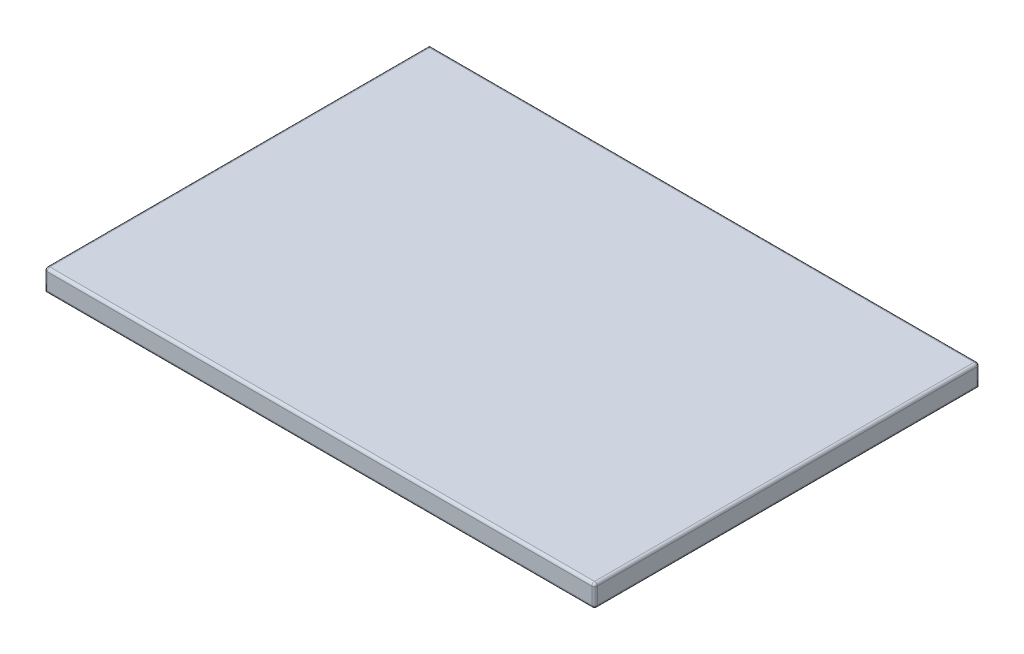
from build123d import *

# Parameters (mm, degrees)
SKETCH2_W           = 100
SKETCH2_H           = 70
BOSS_EXTRUDE1_DEPTH = 4
FILLET1_R           = 0.5
SKETCH3_W           = 5.980620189
SKETCH3_H           = 3.5
SKETCH3_W_2         = 5.075809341
SKETCH3_W_3         = 4.333325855
CUT_EXTRUDE1_DEPTH  = 1


with BuildPart() as part:
    # Sketch2 → Boss-Extrude1 (new body)
    with BuildSketch(Plane(origin=(0, 0, 0), x_dir=(1, 0, 0), z_dir=(0, 1, 0))):
        with Locations((50, -35)):
            Rectangle(SKETCH2_W, SKETCH2_H)
    extrude(amount=BOSS_EXTRUDE1_DEPTH)

    # Fillet1
    fillet1_edges = [part.edges().sort_by_distance(p)[0] for p in [
        (100, 4, 35),
        (50, 4, 0),
        (0, 4, 35),
        (100, 0, 35),
        (50, 0, 70),
        (50, 4, 70),
        (100, 2, 0),
        (100, 2, 70),
        (0, 2, 70),
    ]]
    fillet(fillet1_edges, radius=FILLET1_R)

    # Sketch3 → Cut-Extrude1 (cut)
    with BuildSketch(Plane.ZY):
        with Locations((66.509689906, 1.75)):
            Rectangle(SKETCH3_W, SKETCH3_H)
        with Locations((58.796707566, 1.75)):
            Rectangle(SKETCH3_W_2, SKETCH3_H)
        with Locations((51.224509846, 1.75)):
            Rectangle(SKETCH3_W_3, SKETCH3_H)
    extrude(amount=-CUT_EXTRUDE1_DEPTH, mode=Mode.SUBTRACT)


solid = part.part
